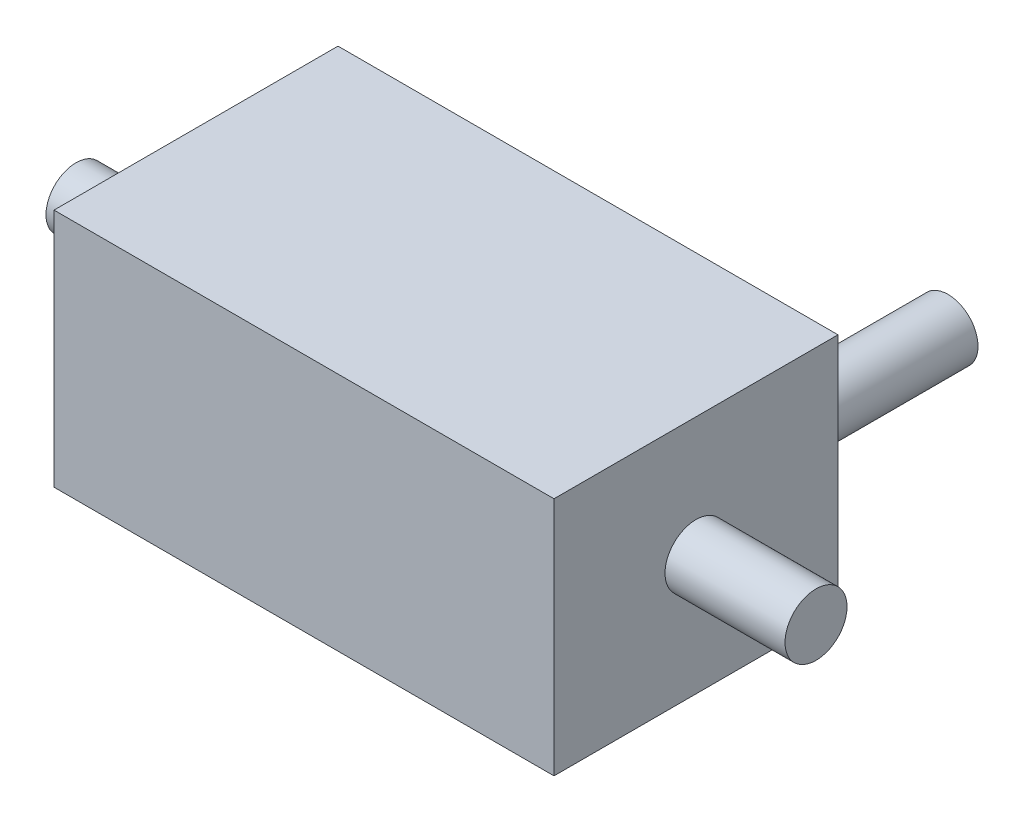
ISO-10303-21;
HEADER;
FILE_DESCRIPTION(('STEP AP214'),'2;1');
FILE_NAME('part.step','',(''),(''),'','','');
FILE_SCHEMA(('AUTOMOTIVE_DESIGN { 1 0 10303 214 1 1 1 1 }'));
ENDSEC;
DATA;
#1=APPLICATION_CONTEXT('core data for automotive mechanical design processes');
#2=APPLICATION_PROTOCOL_DEFINITION('international standard','automotive_design',2000,#1);
#3=PRODUCT_CONTEXT('',#1,'mechanical');
#4=PRODUCT('Part','Part','',(#3));
#5=PRODUCT_RELATED_PRODUCT_CATEGORY('part','',(#4));
#6=PRODUCT_DEFINITION_FORMATION('','',#4);
#7=PRODUCT_DEFINITION_CONTEXT('part definition',#1,'design');
#8=PRODUCT_DEFINITION('design','',#6,#7);
#9=PRODUCT_DEFINITION_SHAPE('','',#8);
#10=(LENGTH_UNIT() NAMED_UNIT(*) SI_UNIT(.MILLI.,.METRE.));
#11=(NAMED_UNIT(*) PLANE_ANGLE_UNIT() SI_UNIT($,.RADIAN.));
#12=(NAMED_UNIT(*) SI_UNIT($,.STERADIAN.) SOLID_ANGLE_UNIT());
#13=UNCERTAINTY_MEASURE_WITH_UNIT(LENGTH_MEASURE(1.E-05),#10,'distance_accuracy_value','');
#14=(GEOMETRIC_REPRESENTATION_CONTEXT(3) GLOBAL_UNCERTAINTY_ASSIGNED_CONTEXT((#13)) GLOBAL_UNIT_ASSIGNED_CONTEXT((#10,
#11,#12)) REPRESENTATION_CONTEXT('',''));
#15=CARTESIAN_POINT('',(0.,0.,0.));
#16=DIRECTION('',(0.,0.,1.));
#17=DIRECTION('',(1.,0.,0.));
#18=AXIS2_PLACEMENT_3D('',#15,#16,#17);
#19=CARTESIAN_POINT('',(0.,12.,0.));
#20=DIRECTION('',(1.,0.,0.));
#21=DIRECTION('',(0.,0.,-1.));
#22=AXIS2_PLACEMENT_3D('',#19,#20,#21);
#23=PLANE('',#22);
#24=CARTESIAN_POINT('',(0.,6.,-7.1));
#25=DIRECTION('',(-1.,0.,0.));
#26=DIRECTION('',(0.,0.,1.));
#27=AXIS2_PLACEMENT_3D('',#24,#25,#26);
#28=CIRCLE('',#27,1.5);
#29=CARTESIAN_POINT('',(0.,6.,-5.6));
#30=VERTEX_POINT('',#29);
#31=EDGE_CURVE('E118',#30,#30,#28,.T.);
#32=ORIENTED_EDGE('',*,*,#31,.F.);
#33=EDGE_LOOP('',(#32));
#34=FACE_BOUND('',#33,.T.);
#35=DIRECTION('',(0.,0.,1.));
#36=VECTOR('',#35,1.);
#37=CARTESIAN_POINT('',(0.,0.,0.));
#38=LINE('',#37,#36);
#39=CARTESIAN_POINT('',(0.,0.,-14.2));
#40=VERTEX_POINT('',#39);
#41=CARTESIAN_POINT('',(0.,0.,0.));
#42=VERTEX_POINT('',#41);
#43=EDGE_CURVE('E110',#40,#42,#38,.T.);
#44=ORIENTED_EDGE('',*,*,#43,.T.);
#45=DIRECTION('',(0.,-1.,0.));
#46=VECTOR('',#45,1.);
#47=CARTESIAN_POINT('',(0.,12.,0.));
#48=LINE('',#47,#46);
#49=CARTESIAN_POINT('',(0.,12.,0.));
#50=VERTEX_POINT('',#49);
#51=EDGE_CURVE('E101',#50,#42,#48,.T.);
#52=ORIENTED_EDGE('',*,*,#51,.F.);
#53=DIRECTION('',(0.,0.,1.));
#54=VECTOR('',#53,1.);
#55=CARTESIAN_POINT('',(0.,12.,0.));
#56=LINE('',#55,#54);
#57=CARTESIAN_POINT('',(0.,12.,-14.2));
#58=VERTEX_POINT('',#57);
#59=EDGE_CURVE('E95',#58,#50,#56,.T.);
#60=ORIENTED_EDGE('',*,*,#59,.F.);
#61=DIRECTION('',(0.,-1.,0.));
#62=VECTOR('',#61,1.);
#63=CARTESIAN_POINT('',(0.,12.,-14.2));
#64=LINE('',#63,#62);
#65=EDGE_CURVE('E106',#58,#40,#64,.T.);
#66=ORIENTED_EDGE('',*,*,#65,.T.);
#67=EDGE_LOOP('',(#44,#52,#60,#66));
#68=FACE_BOUND('',#67,.T.);
#69=ADVANCED_FACE('F43',(#34,#68),#23,.F.);
#70=CARTESIAN_POINT('',(0.,12.,0.));
#71=DIRECTION('',(0.,0.,-1.));
#72=DIRECTION('',(-1.,0.,0.));
#73=AXIS2_PLACEMENT_3D('',#70,#71,#72);
#74=PLANE('',#73);
#75=DIRECTION('',(1.,0.,0.));
#76=VECTOR('',#75,1.);
#77=CARTESIAN_POINT('',(0.,0.,0.));
#78=LINE('',#77,#76);
#79=CARTESIAN_POINT('',(25.,0.,0.));
#80=VERTEX_POINT('',#79);
#81=EDGE_CURVE('E100',#42,#80,#78,.T.);
#82=ORIENTED_EDGE('',*,*,#81,.T.);
#83=DIRECTION('',(0.,-1.,0.));
#84=VECTOR('',#83,1.);
#85=CARTESIAN_POINT('',(25.,12.,0.));
#86=LINE('',#85,#84);
#87=CARTESIAN_POINT('',(25.,12.,0.));
#88=VERTEX_POINT('',#87);
#89=EDGE_CURVE('E98',#88,#80,#86,.T.);
#90=ORIENTED_EDGE('',*,*,#89,.F.);
#91=DIRECTION('',(1.,0.,0.));
#92=VECTOR('',#91,1.);
#93=CARTESIAN_POINT('',(0.,12.,0.));
#94=LINE('',#93,#92);
#95=EDGE_CURVE('E90',#50,#88,#94,.T.);
#96=ORIENTED_EDGE('',*,*,#95,.F.);
#97=ORIENTED_EDGE('',*,*,#51,.T.);
#98=EDGE_LOOP('',(#82,#90,#96,#97));
#99=FACE_BOUND('',#98,.T.);
#100=ADVANCED_FACE('F99',(#99),#74,.F.);
#101=CARTESIAN_POINT('',(25.,12.,0.));
#102=DIRECTION('',(-1.,0.,0.));
#103=DIRECTION('',(0.,0.,1.));
#104=AXIS2_PLACEMENT_3D('',#101,#102,#103);
#105=PLANE('',#104);
#106=CARTESIAN_POINT('',(25.,6.,-7.10000000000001));
#107=DIRECTION('',(1.,0.,0.));
#108=DIRECTION('',(0.,0.,-1.));
#109=AXIS2_PLACEMENT_3D('',#106,#107,#108);
#110=CIRCLE('',#109,1.55);
#111=CARTESIAN_POINT('',(25.,6.,-8.65000000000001));
#112=VERTEX_POINT('',#111);
#113=EDGE_CURVE('E51',#112,#112,#110,.T.);
#114=ORIENTED_EDGE('',*,*,#113,.F.);
#115=EDGE_LOOP('',(#114));
#116=FACE_BOUND('',#115,.T.);
#117=DIRECTION('',(0.,0.,-1.));
#118=VECTOR('',#117,1.);
#119=CARTESIAN_POINT('',(25.,0.,0.));
#120=LINE('',#119,#118);
#121=CARTESIAN_POINT('',(25.,0.,-14.2));
#122=VERTEX_POINT('',#121);
#123=EDGE_CURVE('E76',#80,#122,#120,.T.);
#124=ORIENTED_EDGE('',*,*,#123,.T.);
#125=DIRECTION('',(0.,-1.,0.));
#126=VECTOR('',#125,1.);
#127=CARTESIAN_POINT('',(25.,12.,-14.2));
#128=LINE('',#127,#126);
#129=CARTESIAN_POINT('',(25.,12.,-14.2));
#130=VERTEX_POINT('',#129);
#131=EDGE_CURVE('E102',#130,#122,#128,.T.);
#132=ORIENTED_EDGE('',*,*,#131,.F.);
#133=DIRECTION('',(0.,0.,-1.));
#134=VECTOR('',#133,1.);
#135=CARTESIAN_POINT('',(25.,12.,0.));
#136=LINE('',#135,#134);
#137=EDGE_CURVE('E93',#88,#130,#136,.T.);
#138=ORIENTED_EDGE('',*,*,#137,.F.);
#139=ORIENTED_EDGE('',*,*,#89,.T.);
#140=EDGE_LOOP('',(#124,#132,#138,#139));
#141=FACE_BOUND('',#140,.T.);
#142=ADVANCED_FACE('F104',(#116,#141),#105,.F.);
#143=CARTESIAN_POINT('',(0.,12.,-14.2));
#144=DIRECTION('',(0.,0.,1.));
#145=DIRECTION('',(1.,0.,0.));
#146=AXIS2_PLACEMENT_3D('',#143,#144,#145);
#147=PLANE('',#146);
#148=CARTESIAN_POINT('',(21.5,6.,-14.2));
#149=DIRECTION('',(0.,0.,1.));
#150=DIRECTION('',(1.,0.,0.));
#151=AXIS2_PLACEMENT_3D('',#148,#149,#150);
#152=CIRCLE('',#151,1.5);
#153=CARTESIAN_POINT('',(23.,6.,-14.2));
#154=VERTEX_POINT('',#153);
#155=EDGE_CURVE('E11',#154,#154,#152,.F.);
#156=ORIENTED_EDGE('',*,*,#155,.F.);
#157=EDGE_LOOP('',(#156));
#158=FACE_BOUND('',#157,.T.);
#159=DIRECTION('',(-1.,0.,0.));
#160=VECTOR('',#159,1.);
#161=CARTESIAN_POINT('',(0.,0.,-14.2));
#162=LINE('',#161,#160);
#163=EDGE_CURVE('E82',#122,#40,#162,.T.);
#164=ORIENTED_EDGE('',*,*,#163,.T.);
#165=ORIENTED_EDGE('',*,*,#65,.F.);
#166=DIRECTION('',(-1.,0.,0.));
#167=VECTOR('',#166,1.);
#168=CARTESIAN_POINT('',(0.,12.,-14.2));
#169=LINE('',#168,#167);
#170=EDGE_CURVE('E59',#130,#58,#169,.T.);
#171=ORIENTED_EDGE('',*,*,#170,.F.);
#172=ORIENTED_EDGE('',*,*,#131,.T.);
#173=EDGE_LOOP('',(#164,#165,#171,#172));
#174=FACE_BOUND('',#173,.T.);
#175=ADVANCED_FACE('F162',(#158,#174),#147,.F.);
#176=CARTESIAN_POINT('',(0.,12.,0.));
#177=DIRECTION('',(0.,-1.,0.));
#178=DIRECTION('',(0.,0.,-1.));
#179=AXIS2_PLACEMENT_3D('',#176,#177,#178);
#180=PLANE('',#179);
#181=ORIENTED_EDGE('',*,*,#59,.T.);
#182=ORIENTED_EDGE('',*,*,#95,.T.);
#183=ORIENTED_EDGE('',*,*,#137,.T.);
#184=ORIENTED_EDGE('',*,*,#170,.T.);
#185=EDGE_LOOP('',(#181,#182,#183,#184));
#186=FACE_BOUND('',#185,.T.);
#187=ADVANCED_FACE('F91',(#186),#180,.F.);
#188=CARTESIAN_POINT('',(0.,0.,0.));
#189=DIRECTION('',(0.,-1.,0.));
#190=DIRECTION('',(0.,0.,-1.));
#191=AXIS2_PLACEMENT_3D('',#188,#189,#190);
#192=PLANE('',#191);
#193=ORIENTED_EDGE('',*,*,#43,.F.);
#194=ORIENTED_EDGE('',*,*,#163,.F.);
#195=ORIENTED_EDGE('',*,*,#123,.F.);
#196=ORIENTED_EDGE('',*,*,#81,.F.);
#197=EDGE_LOOP('',(#193,#194,#195,#196));
#198=FACE_BOUND('',#197,.T.);
#199=ADVANCED_FACE('F140',(#198),#192,.T.);
#200=CARTESIAN_POINT('',(-5.,6.,-7.1));
#201=DIRECTION('',(1.,0.,0.));
#202=DIRECTION('',(0.,0.,-1.));
#203=AXIS2_PLACEMENT_3D('',#200,#201,#202);
#204=CYLINDRICAL_SURFACE('',#203,1.5);
#205=ORIENTED_EDGE('',*,*,#31,.T.);
#206=EDGE_LOOP('',(#205));
#207=FACE_BOUND('',#206,.T.);
#208=CARTESIAN_POINT('',(-6.,6.,-7.1));
#209=DIRECTION('',(-1.,0.,0.));
#210=DIRECTION('',(0.,0.,1.));
#211=AXIS2_PLACEMENT_3D('',#208,#209,#210);
#212=CIRCLE('',#211,1.5);
#213=CARTESIAN_POINT('',(-6.,6.,-5.6));
#214=VERTEX_POINT('',#213);
#215=EDGE_CURVE('E131',#214,#214,#212,.T.);
#216=ORIENTED_EDGE('',*,*,#215,.F.);
#217=EDGE_LOOP('',(#216));
#218=FACE_BOUND('',#217,.T.);
#219=ADVANCED_FACE('F137',(#207,#218),#204,.T.);
#220=CARTESIAN_POINT('',(30.,6.,-7.10000000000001));
#221=DIRECTION('',(-1.,0.,0.));
#222=DIRECTION('',(0.,0.,1.));
#223=AXIS2_PLACEMENT_3D('',#220,#221,#222);
#224=CYLINDRICAL_SURFACE('',#223,1.55);
#225=ORIENTED_EDGE('',*,*,#113,.T.);
#226=EDGE_LOOP('',(#225));
#227=FACE_BOUND('',#226,.T.);
#228=CARTESIAN_POINT('',(31.,6.,-7.10000000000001));
#229=DIRECTION('',(1.,0.,0.));
#230=DIRECTION('',(0.,0.,-1.));
#231=AXIS2_PLACEMENT_3D('',#228,#229,#230);
#232=CIRCLE('',#231,1.55);
#233=CARTESIAN_POINT('',(31.,6.,-8.65000000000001));
#234=VERTEX_POINT('',#233);
#235=EDGE_CURVE('E128',#234,#234,#232,.T.);
#236=ORIENTED_EDGE('',*,*,#235,.F.);
#237=EDGE_LOOP('',(#236));
#238=FACE_BOUND('',#237,.T.);
#239=ADVANCED_FACE('F139',(#227,#238),#224,.T.);
#240=CARTESIAN_POINT('',(21.5,6.,-23.2));
#241=DIRECTION('',(0.,0.,1.));
#242=DIRECTION('',(1.,0.,0.));
#243=AXIS2_PLACEMENT_3D('',#240,#241,#242);
#244=CYLINDRICAL_SURFACE('',#243,1.5);
#245=CARTESIAN_POINT('',(21.5,6.,-23.2));
#246=DIRECTION('',(0.,0.,-1.));
#247=DIRECTION('',(-1.,0.,0.));
#248=AXIS2_PLACEMENT_3D('',#245,#246,#247);
#249=CIRCLE('',#248,1.5);
#250=CARTESIAN_POINT('',(20.,6.,-23.2));
#251=VERTEX_POINT('',#250);
#252=EDGE_CURVE('E113',#251,#251,#249,.T.);
#253=ORIENTED_EDGE('',*,*,#252,.F.);
#254=EDGE_LOOP('',(#253));
#255=FACE_BOUND('',#254,.T.);
#256=ORIENTED_EDGE('',*,*,#155,.T.);
#257=EDGE_LOOP('',(#256));
#258=FACE_BOUND('',#257,.T.);
#259=ADVANCED_FACE('F147',(#255,#258),#244,.T.);
#260=CARTESIAN_POINT('',(21.5,6.,-23.2));
#261=DIRECTION('',(0.,0.,-1.));
#262=DIRECTION('',(-1.,0.,0.));
#263=AXIS2_PLACEMENT_3D('',#260,#261,#262);
#264=PLANE('',#263);
#265=ORIENTED_EDGE('',*,*,#252,.T.);
#266=EDGE_LOOP('',(#265));
#267=FACE_BOUND('',#266,.T.);
#268=ADVANCED_FACE('F174',(#267),#264,.T.);
#269=CARTESIAN_POINT('',(31.,6.,-7.10000000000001));
#270=DIRECTION('',(1.,0.,0.));
#271=DIRECTION('',(0.,0.,-1.));
#272=AXIS2_PLACEMENT_3D('',#269,#270,#271);
#273=PLANE('',#272);
#274=ORIENTED_EDGE('',*,*,#235,.T.);
#275=EDGE_LOOP('',(#274));
#276=FACE_BOUND('',#275,.T.);
#277=ADVANCED_FACE('F180',(#276),#273,.T.);
#278=CARTESIAN_POINT('',(-6.,6.,-7.1));
#279=DIRECTION('',(-1.,0.,0.));
#280=DIRECTION('',(0.,0.,1.));
#281=AXIS2_PLACEMENT_3D('',#278,#279,#280);
#282=PLANE('',#281);
#283=ORIENTED_EDGE('',*,*,#215,.T.);
#284=EDGE_LOOP('',(#283));
#285=FACE_BOUND('',#284,.T.);
#286=ADVANCED_FACE('F135',(#285),#282,.T.);
#287=CLOSED_SHELL('',(#69,#100,#142,#175,#187,#199,#219,#239,#259,#268,#277,#286));
#288=MANIFOLD_SOLID_BREP('B2',#287);
#289=ADVANCED_BREP_SHAPE_REPRESENTATION('',(#18,#288),#14);
#290=SHAPE_DEFINITION_REPRESENTATION(#9,#289);
ENDSEC;
END-ISO-10303-21;
